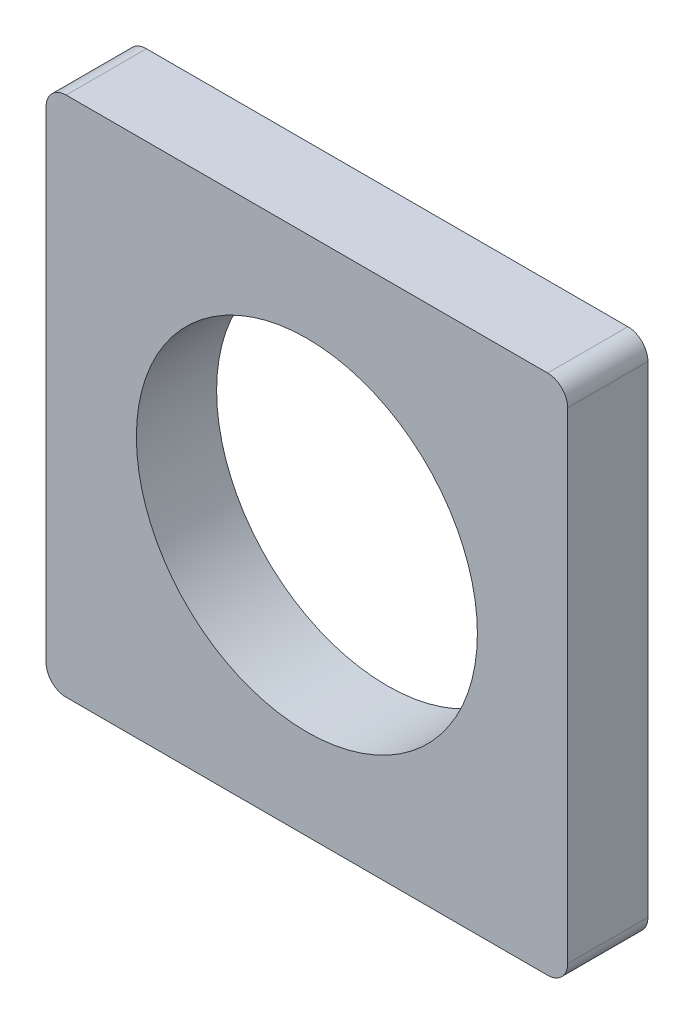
from build123d import *

# Parameters (mm, degrees)
SKETCH1_R           = 4.25
BOSS_EXTRUDE1_DEPTH = 2


with BuildPart() as part:
    # Sketch1 → Boss-Extrude1 (new body)
    with BuildSketch(Plane.XY):
        with BuildLine():
            Line((0.5, 0), (12.5, 0))
            ThreePointArc((12.5, 0), (12.853553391, 0.146446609), (13, 0.5))
            Line((13, 0.5), (13, 12.5))
            ThreePointArc((13, 12.5), (12.853553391, 12.853553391), (12.5, 13))
            Line((12.5, 13), (0.5, 13))
            ThreePointArc((0.5, 13), (0.146446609, 12.853553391), (0, 12.5))
            Line((0, 12.5), (0, 0.5))
            ThreePointArc((0, 0.5), (0.146446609, 0.146446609), (0.5, 0))
        make_face()
        with Locations((6.5, 6.5)):
            Circle(SKETCH1_R, mode=Mode.SUBTRACT)
    extrude(amount=BOSS_EXTRUDE1_DEPTH)


solid = part.part
